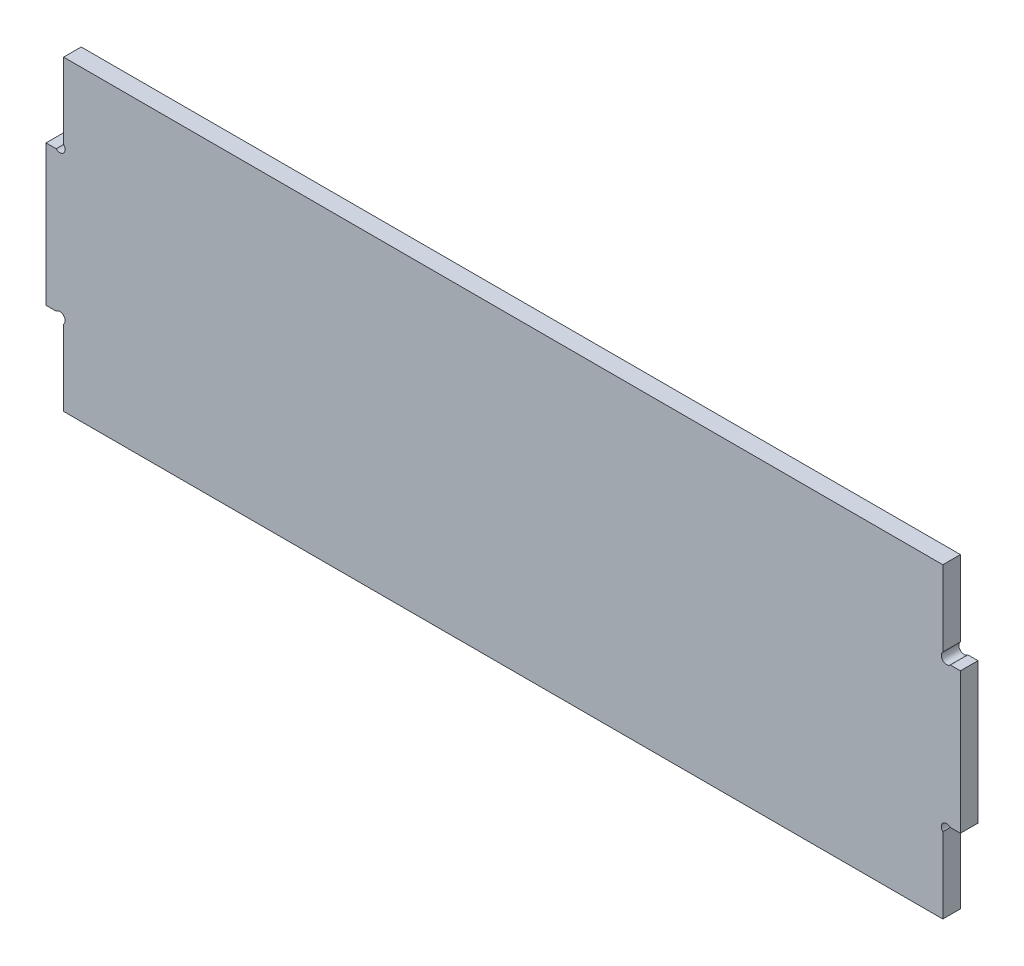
ISO-10303-21;
HEADER;
FILE_DESCRIPTION(('STEP AP214'),'2;1');
FILE_NAME('part.step','',(''),(''),'','','');
FILE_SCHEMA(('AUTOMOTIVE_DESIGN { 1 0 10303 214 1 1 1 1 }'));
ENDSEC;
DATA;
#1=APPLICATION_CONTEXT('core data for automotive mechanical design processes');
#2=APPLICATION_PROTOCOL_DEFINITION('international standard','automotive_design',2000,#1);
#3=PRODUCT_CONTEXT('',#1,'mechanical');
#4=PRODUCT('Part','Part','',(#3));
#5=PRODUCT_RELATED_PRODUCT_CATEGORY('part','',(#4));
#6=PRODUCT_DEFINITION_FORMATION('','',#4);
#7=PRODUCT_DEFINITION_CONTEXT('part definition',#1,'design');
#8=PRODUCT_DEFINITION('design','',#6,#7);
#9=PRODUCT_DEFINITION_SHAPE('','',#8);
#10=(LENGTH_UNIT() NAMED_UNIT(*) SI_UNIT(.MILLI.,.METRE.));
#11=(NAMED_UNIT(*) PLANE_ANGLE_UNIT() SI_UNIT($,.RADIAN.));
#12=(NAMED_UNIT(*) SI_UNIT($,.STERADIAN.) SOLID_ANGLE_UNIT());
#13=UNCERTAINTY_MEASURE_WITH_UNIT(LENGTH_MEASURE(1.E-05),#10,'distance_accuracy_value','');
#14=(GEOMETRIC_REPRESENTATION_CONTEXT(3) GLOBAL_UNCERTAINTY_ASSIGNED_CONTEXT((#13)) GLOBAL_UNIT_ASSIGNED_CONTEXT((#10,
#11,#12)) REPRESENTATION_CONTEXT('',''));
#15=CARTESIAN_POINT('',(0.,0.,0.));
#16=DIRECTION('',(0.,0.,1.));
#17=DIRECTION('',(1.,0.,0.));
#18=AXIS2_PLACEMENT_3D('',#15,#16,#17);
#19=CARTESIAN_POINT('',(0.,173.639844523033,0.));
#20=DIRECTION('',(1.,0.,0.));
#21=DIRECTION('',(0.,1.,0.));
#22=AXIS2_PLACEMENT_3D('',#19,#20,#21);
#23=PLANE('',#22);
#24=DIRECTION('',(0.,1.,0.));
#25=VECTOR('',#24,1.);
#26=CARTESIAN_POINT('',(0.,173.639844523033,0.));
#27=LINE('',#26,#25);
#28=CARTESIAN_POINT('',(0.,-0.855604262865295,0.));
#29=VERTEX_POINT('',#28);
#30=CARTESIAN_POINT('',(0.,42.1494794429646,0.));
#31=VERTEX_POINT('',#30);
#32=EDGE_CURVE('E172',#29,#31,#27,.T.);
#33=ORIENTED_EDGE('',*,*,#32,.T.);
#34=DIRECTION('',(0.,0.,1.));
#35=VECTOR('',#34,1.);
#36=CARTESIAN_POINT('',(0.,42.1494794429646,0.));
#37=LINE('',#36,#35);
#38=CARTESIAN_POINT('',(0.,42.1494794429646,9.99999999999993));
#39=VERTEX_POINT('',#38);
#40=EDGE_CURVE('E159',#31,#39,#37,.T.);
#41=ORIENTED_EDGE('',*,*,#40,.T.);
#42=DIRECTION('',(0.,1.,0.));
#43=VECTOR('',#42,1.);
#44=CARTESIAN_POINT('',(0.,173.639844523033,9.99999999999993));
#45=LINE('',#44,#43);
#46=CARTESIAN_POINT('',(0.,-0.855604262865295,9.99999999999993));
#47=VERTEX_POINT('',#46);
#48=EDGE_CURVE('E197',#47,#39,#45,.T.);
#49=ORIENTED_EDGE('',*,*,#48,.F.);
#50=DIRECTION('',(0.,0.,1.));
#51=VECTOR('',#50,1.);
#52=CARTESIAN_POINT('',(0.,-0.855604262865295,0.));
#53=LINE('',#52,#51);
#54=EDGE_CURVE('E178',#29,#47,#53,.T.);
#55=ORIENTED_EDGE('',*,*,#54,.F.);
#56=EDGE_LOOP('',(#33,#41,#49,#55));
#57=FACE_BOUND('',#56,.T.);
#58=ADVANCED_FACE('F47',(#57),#23,.T.);
#59=CARTESIAN_POINT('',(0.,130.634760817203,9.99999999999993));
#60=VERTEX_POINT('',#59);
#61=CARTESIAN_POINT('',(0.,173.639844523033,9.99999999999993));
#62=VERTEX_POINT('',#61);
#63=EDGE_CURVE('E196',#60,#62,#45,.T.);
#64=ORIENTED_EDGE('',*,*,#63,.F.);
#65=DIRECTION('',(0.,0.,1.));
#66=VECTOR('',#65,1.);
#67=CARTESIAN_POINT('',(0.,130.634760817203,0.));
#68=LINE('',#67,#66);
#69=CARTESIAN_POINT('',(0.,130.634760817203,0.));
#70=VERTEX_POINT('',#69);
#71=EDGE_CURVE('E314',#60,#70,#68,.F.);
#72=ORIENTED_EDGE('',*,*,#71,.T.);
#73=CARTESIAN_POINT('',(0.,173.639844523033,0.));
#74=VERTEX_POINT('',#73);
#75=EDGE_CURVE('E180',#70,#74,#27,.T.);
#76=ORIENTED_EDGE('',*,*,#75,.T.);
#77=DIRECTION('',(0.,0.,1.));
#78=VECTOR('',#77,1.);
#79=CARTESIAN_POINT('',(0.,173.639844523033,0.));
#80=LINE('',#79,#78);
#81=EDGE_CURVE('E206',#74,#62,#80,.T.);
#82=ORIENTED_EDGE('',*,*,#81,.T.);
#83=EDGE_LOOP('',(#64,#72,#76,#82));
#84=FACE_BOUND('',#83,.T.);
#85=ADVANCED_FACE('F312',(#84),#23,.T.);
#86=CARTESIAN_POINT('',(10.,126.392120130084,0.));
#87=DIRECTION('',(0.,1.,0.));
#88=DIRECTION('',(-1.,0.,0.));
#89=AXIS2_PLACEMENT_3D('',#86,#87,#88);
#90=PLANE('',#89);
#91=DIRECTION('',(-1.,0.,0.));
#92=VECTOR('',#91,1.);
#93=CARTESIAN_POINT('',(10.,126.392120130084,0.));
#94=LINE('',#93,#92);
#95=CARTESIAN_POINT('',(10.,126.392120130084,0.));
#96=VERTEX_POINT('',#95);
#97=CARTESIAN_POINT('',(4.24264068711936,126.392120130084,0.));
#98=VERTEX_POINT('',#97);
#99=EDGE_CURVE('E229',#96,#98,#94,.T.);
#100=ORIENTED_EDGE('',*,*,#99,.T.);
#101=DIRECTION('',(0.,0.,1.));
#102=VECTOR('',#101,1.);
#103=CARTESIAN_POINT('',(4.24264068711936,126.392120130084,0.));
#104=LINE('',#103,#102);
#105=CARTESIAN_POINT('',(4.24264068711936,126.392120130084,9.99999999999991));
#106=VERTEX_POINT('',#105);
#107=EDGE_CURVE('E13',#98,#106,#104,.T.);
#108=ORIENTED_EDGE('',*,*,#107,.T.);
#109=DIRECTION('',(-1.,0.,0.));
#110=VECTOR('',#109,1.);
#111=CARTESIAN_POINT('',(10.,126.392120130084,9.99999999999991));
#112=LINE('',#111,#110);
#113=CARTESIAN_POINT('',(10.,126.392120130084,9.99999999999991));
#114=VERTEX_POINT('',#113);
#115=EDGE_CURVE('E226',#114,#106,#112,.T.);
#116=ORIENTED_EDGE('',*,*,#115,.F.);
#117=DIRECTION('',(0.,0.,-1.));
#118=VECTOR('',#117,1.);
#119=CARTESIAN_POINT('',(10.,126.392120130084,0.));
#120=LINE('',#119,#118);
#121=EDGE_CURVE('E322',#114,#96,#120,.T.);
#122=ORIENTED_EDGE('',*,*,#121,.T.);
#123=EDGE_LOOP('',(#100,#108,#116,#122));
#124=FACE_BOUND('',#123,.T.);
#125=ADVANCED_FACE('F320',(#124),#90,.T.);
#126=CARTESIAN_POINT('',(10.,46.3921201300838,0.));
#127=DIRECTION('',(0.,-1.,0.));
#128=DIRECTION('',(1.,0.,0.));
#129=AXIS2_PLACEMENT_3D('',#126,#127,#128);
#130=PLANE('',#129);
#131=DIRECTION('',(-1.,0.,0.));
#132=VECTOR('',#131,1.);
#133=CARTESIAN_POINT('',(10.,46.3921201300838,9.99999999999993));
#134=LINE('',#133,#132);
#135=CARTESIAN_POINT('',(10.,46.3921201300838,9.99999999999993));
#136=VERTEX_POINT('',#135);
#137=CARTESIAN_POINT('',(4.24264068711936,46.3921201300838,9.99999999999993));
#138=VERTEX_POINT('',#137);
#139=EDGE_CURVE('E220',#136,#138,#134,.T.);
#140=ORIENTED_EDGE('',*,*,#139,.T.);
#141=DIRECTION('',(0.,0.,1.));
#142=VECTOR('',#141,1.);
#143=CARTESIAN_POINT('',(4.24264068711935,46.3921201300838,0.));
#144=LINE('',#143,#142);
#145=CARTESIAN_POINT('',(4.24264068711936,46.3921201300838,0.));
#146=VERTEX_POINT('',#145);
#147=EDGE_CURVE('E55',#138,#146,#144,.F.);
#148=ORIENTED_EDGE('',*,*,#147,.T.);
#149=DIRECTION('',(-1.,0.,0.));
#150=VECTOR('',#149,1.);
#151=CARTESIAN_POINT('',(10.,46.3921201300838,0.));
#152=LINE('',#151,#150);
#153=CARTESIAN_POINT('',(10.,46.3921201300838,0.));
#154=VERTEX_POINT('',#153);
#155=EDGE_CURVE('E175',#154,#146,#152,.T.);
#156=ORIENTED_EDGE('',*,*,#155,.F.);
#157=DIRECTION('',(0.,0.,1.));
#158=VECTOR('',#157,1.);
#159=CARTESIAN_POINT('',(10.,46.3921201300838,0.));
#160=LINE('',#159,#158);
#161=EDGE_CURVE('E222',#154,#136,#160,.T.);
#162=ORIENTED_EDGE('',*,*,#161,.T.);
#163=EDGE_LOOP('',(#140,#148,#156,#162));
#164=FACE_BOUND('',#163,.T.);
#165=ADVANCED_FACE('F218',(#164),#130,.T.);
#166=CARTESIAN_POINT('',(-500.,173.639844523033,0.));
#167=DIRECTION('',(-1.,0.,0.));
#168=DIRECTION('',(0.,0.,1.));
#169=AXIS2_PLACEMENT_3D('',#166,#167,#168);
#170=PLANE('',#169);
#171=DIRECTION('',(0.,0.,1.));
#172=VECTOR('',#171,1.);
#173=CARTESIAN_POINT('',(-500.,130.634760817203,0.));
#174=LINE('',#173,#172);
#175=CARTESIAN_POINT('',(-500.,130.634760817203,9.99999999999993));
#176=VERTEX_POINT('',#175);
#177=CARTESIAN_POINT('',(-500.,130.634760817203,0.));
#178=VERTEX_POINT('',#177);
#179=EDGE_CURVE('E243',#176,#178,#174,.F.);
#180=ORIENTED_EDGE('',*,*,#179,.F.);
#181=DIRECTION('',(0.,-1.,0.));
#182=VECTOR('',#181,1.);
#183=CARTESIAN_POINT('',(-500.,173.639844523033,9.99999999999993));
#184=LINE('',#183,#182);
#185=CARTESIAN_POINT('',(-500.,173.639844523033,9.99999999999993));
#186=VERTEX_POINT('',#185);
#187=EDGE_CURVE('E189',#186,#176,#184,.T.);
#188=ORIENTED_EDGE('',*,*,#187,.F.);
#189=DIRECTION('',(0.,0.,1.));
#190=VECTOR('',#189,1.);
#191=CARTESIAN_POINT('',(-500.,173.639844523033,0.));
#192=LINE('',#191,#190);
#193=CARTESIAN_POINT('',(-500.,173.639844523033,0.));
#194=VERTEX_POINT('',#193);
#195=EDGE_CURVE('E203',#194,#186,#192,.T.);
#196=ORIENTED_EDGE('',*,*,#195,.F.);
#197=DIRECTION('',(0.,-1.,0.));
#198=VECTOR('',#197,1.);
#199=CARTESIAN_POINT('',(-500.,173.639844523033,0.));
#200=LINE('',#199,#198);
#201=EDGE_CURVE('E270',#194,#178,#200,.T.);
#202=ORIENTED_EDGE('',*,*,#201,.T.);
#203=EDGE_LOOP('',(#180,#188,#196,#202));
#204=FACE_BOUND('',#203,.T.);
#205=ADVANCED_FACE('F361',(#204),#170,.T.);
#206=DIRECTION('',(0.,0.,1.));
#207=VECTOR('',#206,1.);
#208=CARTESIAN_POINT('',(-500.,42.1494794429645,0.));
#209=LINE('',#208,#207);
#210=CARTESIAN_POINT('',(-500.,42.1494794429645,0.));
#211=VERTEX_POINT('',#210);
#212=CARTESIAN_POINT('',(-500.,42.1494794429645,9.99999999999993));
#213=VERTEX_POINT('',#212);
#214=EDGE_CURVE('E248',#211,#213,#209,.T.);
#215=ORIENTED_EDGE('',*,*,#214,.F.);
#216=CARTESIAN_POINT('',(-500.,-0.855604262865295,0.));
#217=VERTEX_POINT('',#216);
#218=EDGE_CURVE('E202',#211,#217,#200,.T.);
#219=ORIENTED_EDGE('',*,*,#218,.T.);
#220=DIRECTION('',(0.,0.,1.));
#221=VECTOR('',#220,1.);
#222=CARTESIAN_POINT('',(-500.,-0.855604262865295,0.));
#223=LINE('',#222,#221);
#224=CARTESIAN_POINT('',(-500.,-0.855604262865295,9.99999999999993));
#225=VERTEX_POINT('',#224);
#226=EDGE_CURVE('E183',#217,#225,#223,.T.);
#227=ORIENTED_EDGE('',*,*,#226,.T.);
#228=EDGE_CURVE('E193',#213,#225,#184,.T.);
#229=ORIENTED_EDGE('',*,*,#228,.F.);
#230=EDGE_LOOP('',(#215,#219,#227,#229));
#231=FACE_BOUND('',#230,.T.);
#232=ADVANCED_FACE('F49',(#231),#170,.T.);
#233=CARTESIAN_POINT('',(-500.,173.639844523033,0.));
#234=DIRECTION('',(0.,1.,0.));
#235=DIRECTION('',(0.,0.,1.));
#236=AXIS2_PLACEMENT_3D('',#233,#234,#235);
#237=PLANE('',#236);
#238=DIRECTION('',(-1.,0.,0.));
#239=VECTOR('',#238,1.);
#240=CARTESIAN_POINT('',(-500.,173.639844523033,9.99999999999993));
#241=LINE('',#240,#239);
#242=EDGE_CURVE('E199',#62,#186,#241,.T.);
#243=ORIENTED_EDGE('',*,*,#242,.F.);
#244=ORIENTED_EDGE('',*,*,#81,.F.);
#245=DIRECTION('',(-1.,0.,0.));
#246=VECTOR('',#245,1.);
#247=CARTESIAN_POINT('',(-500.,173.639844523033,0.));
#248=LINE('',#247,#246);
#249=EDGE_CURVE('E179',#74,#194,#248,.T.);
#250=ORIENTED_EDGE('',*,*,#249,.T.);
#251=ORIENTED_EDGE('',*,*,#195,.T.);
#252=EDGE_LOOP('',(#243,#244,#250,#251));
#253=FACE_BOUND('',#252,.T.);
#254=ADVANCED_FACE('F308',(#253),#237,.T.);
#255=CARTESIAN_POINT('',(-500.,-0.855604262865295,0.));
#256=DIRECTION('',(0.,-1.,0.));
#257=DIRECTION('',(0.,0.,-1.));
#258=AXIS2_PLACEMENT_3D('',#255,#256,#257);
#259=PLANE('',#258);
#260=DIRECTION('',(1.,0.,0.));
#261=VECTOR('',#260,1.);
#262=CARTESIAN_POINT('',(-500.,-0.855604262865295,9.99999999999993));
#263=LINE('',#262,#261);
#264=EDGE_CURVE('E192',#225,#47,#263,.T.);
#265=ORIENTED_EDGE('',*,*,#264,.F.);
#266=ORIENTED_EDGE('',*,*,#226,.F.);
#267=DIRECTION('',(1.,0.,0.));
#268=VECTOR('',#267,1.);
#269=CARTESIAN_POINT('',(-500.,-0.855604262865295,0.));
#270=LINE('',#269,#268);
#271=EDGE_CURVE('E185',#217,#29,#270,.T.);
#272=ORIENTED_EDGE('',*,*,#271,.T.);
#273=ORIENTED_EDGE('',*,*,#54,.T.);
#274=EDGE_LOOP('',(#265,#266,#272,#273));
#275=FACE_BOUND('',#274,.T.);
#276=ADVANCED_FACE('F282',(#275),#259,.T.);
#277=CARTESIAN_POINT('',(0.,0.,0.));
#278=DIRECTION('',(0.,0.,1.));
#279=DIRECTION('',(1.,0.,0.));
#280=AXIS2_PLACEMENT_3D('',#277,#278,#279);
#281=PLANE('',#280);
#282=CARTESIAN_POINT('',(2.12132034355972,128.513440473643,0.));
#283=DIRECTION('',(0.,0.,-1.));
#284=DIRECTION('',(-1.,0.,0.));
#285=AXIS2_PLACEMENT_3D('',#282,#283,#284);
#286=CIRCLE('',#285,2.99999999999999);
#287=EDGE_CURVE('E176',#98,#70,#286,.T.);
#288=ORIENTED_EDGE('',*,*,#287,.F.);
#289=ORIENTED_EDGE('',*,*,#99,.F.);
#290=DIRECTION('',(0.,-1.,0.));
#291=VECTOR('',#290,1.);
#292=CARTESIAN_POINT('',(10.,46.3921201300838,0.));
#293=LINE('',#292,#291);
#294=EDGE_CURVE('E325',#96,#154,#293,.T.);
#295=ORIENTED_EDGE('',*,*,#294,.T.);
#296=ORIENTED_EDGE('',*,*,#155,.T.);
#297=CARTESIAN_POINT('',(2.12132034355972,44.2707997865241,0.));
#298=DIRECTION('',(0.,0.,-1.));
#299=DIRECTION('',(1.,0.,0.));
#300=AXIS2_PLACEMENT_3D('',#297,#298,#299);
#301=CIRCLE('',#300,2.99999999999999);
#302=EDGE_CURVE('E69',#31,#146,#301,.T.);
#303=ORIENTED_EDGE('',*,*,#302,.F.);
#304=ORIENTED_EDGE('',*,*,#32,.F.);
#305=ORIENTED_EDGE('',*,*,#271,.F.);
#306=ORIENTED_EDGE('',*,*,#218,.F.);
#307=CARTESIAN_POINT('',(-502.12132034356,44.270799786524,0.));
#308=DIRECTION('',(0.,0.,1.));
#309=DIRECTION('',(-1.,0.,0.));
#310=AXIS2_PLACEMENT_3D('',#307,#308,#309);
#311=CIRCLE('',#310,2.99999999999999);
#312=CARTESIAN_POINT('',(-504.24264068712,46.3921201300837,0.));
#313=VERTEX_POINT('',#312);
#314=EDGE_CURVE('E236',#211,#313,#311,.T.);
#315=ORIENTED_EDGE('',*,*,#314,.T.);
#316=DIRECTION('',(1.,0.,0.));
#317=VECTOR('',#316,1.);
#318=CARTESIAN_POINT('',(-510.,46.3921201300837,0.));
#319=LINE('',#318,#317);
#320=CARTESIAN_POINT('',(-510.,46.3921201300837,0.));
#321=VERTEX_POINT('',#320);
#322=EDGE_CURVE('E268',#321,#313,#319,.T.);
#323=ORIENTED_EDGE('',*,*,#322,.F.);
#324=DIRECTION('',(0.,-1.,0.));
#325=VECTOR('',#324,1.);
#326=CARTESIAN_POINT('',(-510.,46.3921201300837,0.));
#327=LINE('',#326,#325);
#328=CARTESIAN_POINT('',(-510.,126.392120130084,0.));
#329=VERTEX_POINT('',#328);
#330=EDGE_CURVE('E250',#329,#321,#327,.T.);
#331=ORIENTED_EDGE('',*,*,#330,.F.);
#332=DIRECTION('',(1.,0.,0.));
#333=VECTOR('',#332,1.);
#334=CARTESIAN_POINT('',(-510.,126.392120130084,0.));
#335=LINE('',#334,#333);
#336=CARTESIAN_POINT('',(-504.24264068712,126.392120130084,0.));
#337=VERTEX_POINT('',#336);
#338=EDGE_CURVE('E259',#329,#337,#335,.T.);
#339=ORIENTED_EDGE('',*,*,#338,.T.);
#340=CARTESIAN_POINT('',(-502.12132034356,128.513440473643,0.));
#341=DIRECTION('',(0.,0.,1.));
#342=DIRECTION('',(1.,0.,0.));
#343=AXIS2_PLACEMENT_3D('',#340,#341,#342);
#344=CIRCLE('',#343,2.99999999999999);
#345=EDGE_CURVE('E237',#337,#178,#344,.T.);
#346=ORIENTED_EDGE('',*,*,#345,.T.);
#347=ORIENTED_EDGE('',*,*,#201,.F.);
#348=ORIENTED_EDGE('',*,*,#249,.F.);
#349=ORIENTED_EDGE('',*,*,#75,.F.);
#350=EDGE_LOOP('',(#288,#289,#295,#296,#303,#304,#305,#306,#315,#323,#331,#339,#346,#347,#348,#349));
#351=FACE_BOUND('',#350,.T.);
#352=ADVANCED_FACE('F170',(#351),#281,.F.);
#353=CARTESIAN_POINT('',(0.,0.,9.99999999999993));
#354=DIRECTION('',(0.,0.,1.));
#355=DIRECTION('',(1.,0.,0.));
#356=AXIS2_PLACEMENT_3D('',#353,#354,#355);
#357=PLANE('',#356);
#358=ORIENTED_EDGE('',*,*,#115,.T.);
#359=CARTESIAN_POINT('',(2.12132034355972,128.513440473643,9.99999999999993));
#360=DIRECTION('',(0.,0.,1.));
#361=DIRECTION('',(1.,0.,0.));
#362=AXIS2_PLACEMENT_3D('',#359,#360,#361);
#363=CIRCLE('',#362,2.99999999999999);
#364=EDGE_CURVE('E62',#106,#60,#363,.F.);
#365=ORIENTED_EDGE('',*,*,#364,.T.);
#366=ORIENTED_EDGE('',*,*,#63,.T.);
#367=ORIENTED_EDGE('',*,*,#242,.T.);
#368=ORIENTED_EDGE('',*,*,#187,.T.);
#369=CARTESIAN_POINT('',(-502.12132034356,128.513440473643,9.99999999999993));
#370=DIRECTION('',(0.,0.,1.));
#371=DIRECTION('',(1.,0.,0.));
#372=AXIS2_PLACEMENT_3D('',#369,#370,#371);
#373=CIRCLE('',#372,2.99999999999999);
#374=CARTESIAN_POINT('',(-504.24264068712,126.392120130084,9.99999999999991));
#375=VERTEX_POINT('',#374);
#376=EDGE_CURVE('E239',#375,#176,#373,.T.);
#377=ORIENTED_EDGE('',*,*,#376,.F.);
#378=DIRECTION('',(1.,0.,0.));
#379=VECTOR('',#378,1.);
#380=CARTESIAN_POINT('',(-510.,126.392120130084,9.99999999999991));
#381=LINE('',#380,#379);
#382=CARTESIAN_POINT('',(-510.,126.392120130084,9.99999999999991));
#383=VERTEX_POINT('',#382);
#384=EDGE_CURVE('E262',#383,#375,#381,.T.);
#385=ORIENTED_EDGE('',*,*,#384,.F.);
#386=DIRECTION('',(0.,1.,0.));
#387=VECTOR('',#386,1.);
#388=CARTESIAN_POINT('',(-510.,46.3921201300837,9.99999999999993));
#389=LINE('',#388,#387);
#390=CARTESIAN_POINT('',(-510.,46.3921201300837,9.99999999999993));
#391=VERTEX_POINT('',#390);
#392=EDGE_CURVE('E255',#391,#383,#389,.T.);
#393=ORIENTED_EDGE('',*,*,#392,.F.);
#394=DIRECTION('',(1.,0.,0.));
#395=VECTOR('',#394,1.);
#396=CARTESIAN_POINT('',(-510.,46.3921201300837,9.99999999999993));
#397=LINE('',#396,#395);
#398=CARTESIAN_POINT('',(-504.24264068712,46.3921201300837,9.99999999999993));
#399=VERTEX_POINT('',#398);
#400=EDGE_CURVE('E265',#391,#399,#397,.T.);
#401=ORIENTED_EDGE('',*,*,#400,.T.);
#402=CARTESIAN_POINT('',(-502.12132034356,44.270799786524,9.99999999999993));
#403=DIRECTION('',(0.,0.,1.));
#404=DIRECTION('',(1.,0.,0.));
#405=AXIS2_PLACEMENT_3D('',#402,#403,#404);
#406=CIRCLE('',#405,2.99999999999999);
#407=EDGE_CURVE('E246',#213,#399,#406,.T.);
#408=ORIENTED_EDGE('',*,*,#407,.F.);
#409=ORIENTED_EDGE('',*,*,#228,.T.);
#410=ORIENTED_EDGE('',*,*,#264,.T.);
#411=ORIENTED_EDGE('',*,*,#48,.T.);
#412=CARTESIAN_POINT('',(2.12132034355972,44.2707997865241,9.99999999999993));
#413=DIRECTION('',(0.,0.,1.));
#414=DIRECTION('',(1.,0.,0.));
#415=AXIS2_PLACEMENT_3D('',#412,#413,#414);
#416=CIRCLE('',#415,2.99999999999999);
#417=EDGE_CURVE('E161',#39,#138,#416,.F.);
#418=ORIENTED_EDGE('',*,*,#417,.T.);
#419=ORIENTED_EDGE('',*,*,#139,.F.);
#420=DIRECTION('',(0.,1.,0.));
#421=VECTOR('',#420,1.);
#422=CARTESIAN_POINT('',(10.,46.3921201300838,9.99999999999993));
#423=LINE('',#422,#421);
#424=EDGE_CURVE('E324',#136,#114,#423,.T.);
#425=ORIENTED_EDGE('',*,*,#424,.T.);
#426=EDGE_LOOP('',(#358,#365,#366,#367,#368,#377,#385,#393,#401,#408,#409,#410,#411,#418,#419,#425));
#427=FACE_BOUND('',#426,.T.);
#428=ADVANCED_FACE('F283',(#427),#357,.T.);
#429=CARTESIAN_POINT('',(-510.,46.3921201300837,0.));
#430=DIRECTION('',(0.,1.,0.));
#431=DIRECTION('',(0.,0.,1.));
#432=AXIS2_PLACEMENT_3D('',#429,#430,#431);
#433=PLANE('',#432);
#434=ORIENTED_EDGE('',*,*,#322,.T.);
#435=DIRECTION('',(0.,0.,1.));
#436=VECTOR('',#435,1.);
#437=CARTESIAN_POINT('',(-504.24264068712,46.3921201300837,0.));
#438=LINE('',#437,#436);
#439=EDGE_CURVE('E214',#313,#399,#438,.T.);
#440=ORIENTED_EDGE('',*,*,#439,.T.);
#441=ORIENTED_EDGE('',*,*,#400,.F.);
#442=DIRECTION('',(0.,0.,1.));
#443=VECTOR('',#442,1.);
#444=CARTESIAN_POINT('',(-510.,46.3921201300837,0.));
#445=LINE('',#444,#443);
#446=EDGE_CURVE('E253',#321,#391,#445,.T.);
#447=ORIENTED_EDGE('',*,*,#446,.F.);
#448=EDGE_LOOP('',(#434,#440,#441,#447));
#449=FACE_BOUND('',#448,.T.);
#450=ADVANCED_FACE('F290',(#449),#433,.F.);
#451=CARTESIAN_POINT('',(-510.,126.392120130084,0.));
#452=DIRECTION('',(0.,-1.,0.));
#453=DIRECTION('',(0.,0.,-1.));
#454=AXIS2_PLACEMENT_3D('',#451,#452,#453);
#455=PLANE('',#454);
#456=ORIENTED_EDGE('',*,*,#384,.T.);
#457=DIRECTION('',(0.,0.,1.));
#458=VECTOR('',#457,1.);
#459=CARTESIAN_POINT('',(-504.24264068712,126.392120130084,0.));
#460=LINE('',#459,#458);
#461=EDGE_CURVE('E205',#375,#337,#460,.F.);
#462=ORIENTED_EDGE('',*,*,#461,.T.);
#463=ORIENTED_EDGE('',*,*,#338,.F.);
#464=DIRECTION('',(0.,0.,-1.));
#465=VECTOR('',#464,1.);
#466=CARTESIAN_POINT('',(-510.,126.392120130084,0.));
#467=LINE('',#466,#465);
#468=EDGE_CURVE('E257',#383,#329,#467,.T.);
#469=ORIENTED_EDGE('',*,*,#468,.F.);
#470=EDGE_LOOP('',(#456,#462,#463,#469));
#471=FACE_BOUND('',#470,.T.);
#472=ADVANCED_FACE('F299',(#471),#455,.F.);
#473=CARTESIAN_POINT('',(-510.,0.,0.));
#474=DIRECTION('',(1.,0.,0.));
#475=DIRECTION('',(0.,0.,-1.));
#476=AXIS2_PLACEMENT_3D('',#473,#474,#475);
#477=PLANE('',#476);
#478=ORIENTED_EDGE('',*,*,#330,.T.);
#479=ORIENTED_EDGE('',*,*,#446,.T.);
#480=ORIENTED_EDGE('',*,*,#392,.T.);
#481=ORIENTED_EDGE('',*,*,#468,.T.);
#482=EDGE_LOOP('',(#478,#479,#480,#481));
#483=FACE_BOUND('',#482,.T.);
#484=ADVANCED_FACE('F295',(#483),#477,.F.);
#485=CARTESIAN_POINT('',(-502.12132034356,128.513440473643,0.));
#486=DIRECTION('',(0.,0.,1.));
#487=DIRECTION('',(1.,0.,0.));
#488=AXIS2_PLACEMENT_3D('',#485,#486,#487);
#489=CYLINDRICAL_SURFACE('',#488,2.99999999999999);
#490=ORIENTED_EDGE('',*,*,#345,.F.);
#491=ORIENTED_EDGE('',*,*,#461,.F.);
#492=ORIENTED_EDGE('',*,*,#376,.T.);
#493=ORIENTED_EDGE('',*,*,#179,.T.);
#494=EDGE_LOOP('',(#490,#491,#492,#493));
#495=FACE_BOUND('',#494,.T.);
#496=ADVANCED_FACE('F302',(#495),#489,.F.);
#497=CARTESIAN_POINT('',(-502.12132034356,44.270799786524,0.));
#498=DIRECTION('',(0.,0.,1.));
#499=DIRECTION('',(1.,0.,0.));
#500=AXIS2_PLACEMENT_3D('',#497,#498,#499);
#501=CYLINDRICAL_SURFACE('',#500,2.99999999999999);
#502=ORIENTED_EDGE('',*,*,#314,.F.);
#503=ORIENTED_EDGE('',*,*,#214,.T.);
#504=ORIENTED_EDGE('',*,*,#407,.T.);
#505=ORIENTED_EDGE('',*,*,#439,.F.);
#506=EDGE_LOOP('',(#502,#503,#504,#505));
#507=FACE_BOUND('',#506,.T.);
#508=ADVANCED_FACE('F288',(#507),#501,.F.);
#509=CARTESIAN_POINT('',(10.,0.,0.));
#510=DIRECTION('',(-1.,0.,0.));
#511=DIRECTION('',(0.,0.,-1.));
#512=AXIS2_PLACEMENT_3D('',#509,#510,#511);
#513=PLANE('',#512);
#514=ORIENTED_EDGE('',*,*,#294,.F.);
#515=ORIENTED_EDGE('',*,*,#121,.F.);
#516=ORIENTED_EDGE('',*,*,#424,.F.);
#517=ORIENTED_EDGE('',*,*,#161,.F.);
#518=EDGE_LOOP('',(#514,#515,#516,#517));
#519=FACE_BOUND('',#518,.T.);
#520=ADVANCED_FACE('F332',(#519),#513,.F.);
#521=CARTESIAN_POINT('',(2.12132034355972,44.2707997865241,0.));
#522=DIRECTION('',(0.,0.,1.));
#523=DIRECTION('',(1.,0.,0.));
#524=AXIS2_PLACEMENT_3D('',#521,#522,#523);
#525=CYLINDRICAL_SURFACE('',#524,2.99999999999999);
#526=ORIENTED_EDGE('',*,*,#302,.T.);
#527=ORIENTED_EDGE('',*,*,#147,.F.);
#528=ORIENTED_EDGE('',*,*,#417,.F.);
#529=ORIENTED_EDGE('',*,*,#40,.F.);
#530=EDGE_LOOP('',(#526,#527,#528,#529));
#531=FACE_BOUND('',#530,.T.);
#532=ADVANCED_FACE('F160',(#531),#525,.F.);
#533=CARTESIAN_POINT('',(2.12132034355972,128.513440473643,0.));
#534=DIRECTION('',(0.,0.,1.));
#535=DIRECTION('',(1.,0.,0.));
#536=AXIS2_PLACEMENT_3D('',#533,#534,#535);
#537=CYLINDRICAL_SURFACE('',#536,2.99999999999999);
#538=ORIENTED_EDGE('',*,*,#107,.F.);
#539=ORIENTED_EDGE('',*,*,#287,.T.);
#540=ORIENTED_EDGE('',*,*,#71,.F.);
#541=ORIENTED_EDGE('',*,*,#364,.F.);
#542=EDGE_LOOP('',(#538,#539,#540,#541));
#543=FACE_BOUND('',#542,.T.);
#544=ADVANCED_FACE('F317',(#543),#537,.F.);
#545=CLOSED_SHELL('',(#58,#85,#125,#165,#205,#232,#254,#276,#352,#428,#450,#472,#484,#496,#508,
#520,#532,#544));
#546=MANIFOLD_SOLID_BREP('B2',#545);
#547=ADVANCED_BREP_SHAPE_REPRESENTATION('',(#18,#546),#14);
#548=SHAPE_DEFINITION_REPRESENTATION(#9,#547);
ENDSEC;
END-ISO-10303-21;
